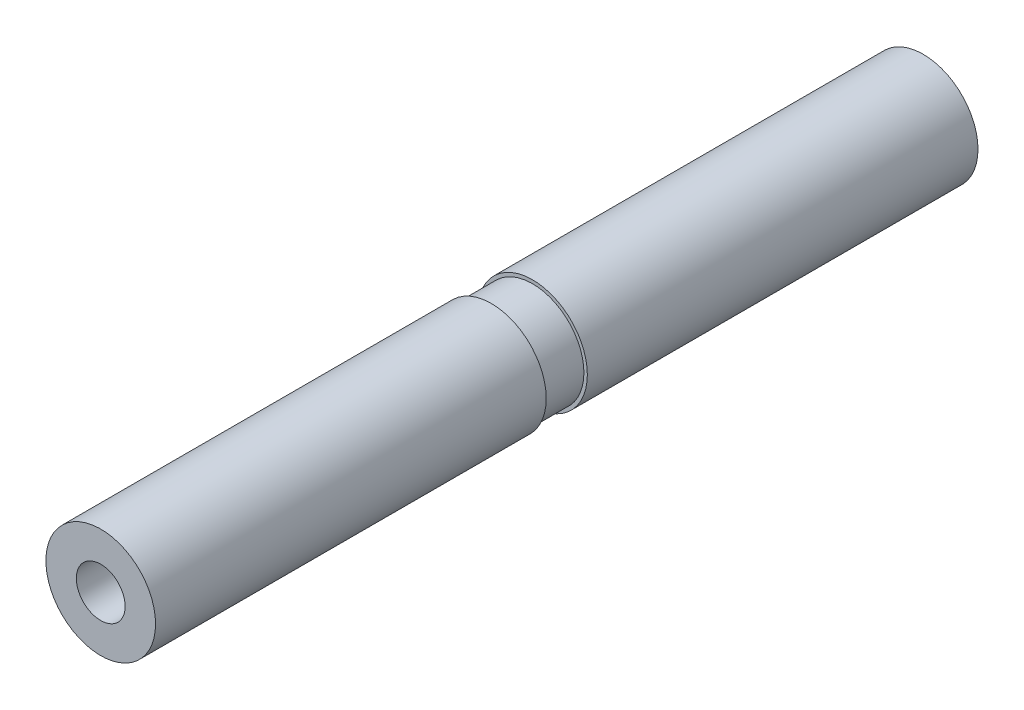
from build123d import *

# Parameters (mm, degrees)
SKETCH1_R               = 2.54
BOSS_EXTRUDE1_DEPTH     = 38.1
F_4_40_TAPPED_HOLE2_D   = 2.2606
CUT_EXTRUDE1_DEPTH      = 0.9525
CUT_EXTRUDE1_DEPTH_BACK = 0.9525
SKETCH5_R               = 2.54
SKETCH5_R_2             = 2.38125


with BuildPart() as part:
    # Sketch1 → Boss-Extrude1 (new body)
    with BuildSketch(Plane.XY):
        with Locations(Location((0, 0, 0), (0, 0, 180))):
            Circle(SKETCH1_R)
    extrude(amount=BOSS_EXTRUDE1_DEPTH)

    # 4-40 Tapped Hole2 (through all)
    with Locations(Plane.XY.offset(38.1)):
        with Locations((0, 0)):
            Hole(F_4_40_TAPPED_HOLE2_D / 2)

    # Sketch5 → Cut-Extrude1 (cut, two sides: drawn at the far end of the back side and taken through both)
    with BuildSketch(Plane.XY.offset(19.05).offset(-CUT_EXTRUDE1_DEPTH_BACK)):
        Circle(SKETCH5_R)
        Circle(SKETCH5_R_2, mode=Mode.SUBTRACT)
    extrude(amount=CUT_EXTRUDE1_DEPTH + CUT_EXTRUDE1_DEPTH_BACK, mode=Mode.SUBTRACT)


solid = part.part
